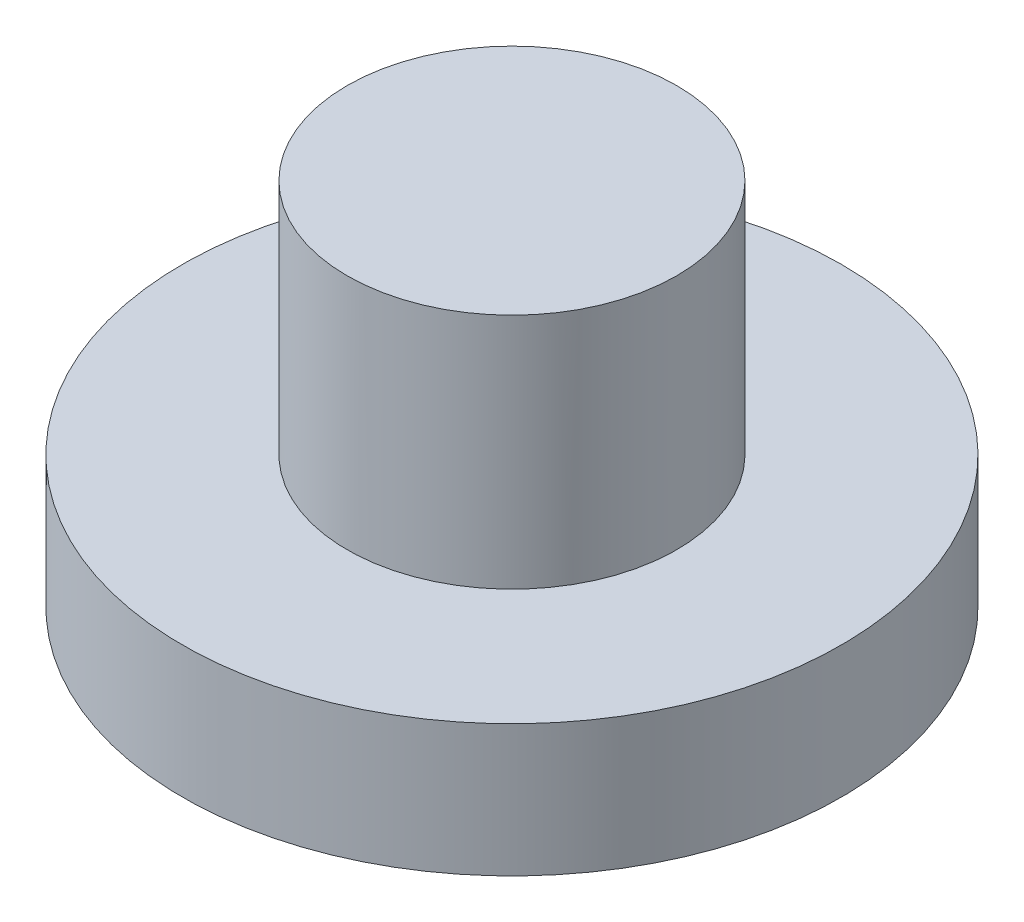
from build123d import *

# Parameters (mm, degrees)
SKETCH1_R           = 0.79375
BOSS_EXTRUDE1_DEPTH = 1.143
SKETCH2_R           = 1.5875
BOSS_EXTRUDE2_DEPTH = 0.635


with BuildPart() as part:
    # Sketch1 → Boss-Extrude1 (new body)
    with BuildSketch(Plane(origin=(0, 0, 0), x_dir=(1, 0, 0), z_dir=(0, 1, 0))):
        with Locations(Location((0, 0, 0), (0, 0, 270))):
            Circle(SKETCH1_R)
    extrude(amount=BOSS_EXTRUDE1_DEPTH)

    # Sketch2 → Boss-Extrude2 (add)
    with BuildSketch(Plane.XZ):
        with Locations(Location((0, 0, 0), (0, 0, 270))):
            Circle(SKETCH2_R)
    extrude(amount=BOSS_EXTRUDE2_DEPTH)

    # Sketch3 → Revolve1 (revolve)
    with BuildSketch(Plane(origin=(0, 0, 0), x_dir=(0, 0, -1), z_dir=(1, 0, 0))):
        with BuildLine():
            Line((0, -1.016), (0, -0.635))
            Line((0, -0.635), (1.5875, -0.635))
            ThreePointArc((1.5875, -0.635), (0.816289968, -0.919416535), (0, -1.016))
        make_face()
    revolve(axis=Axis((0, 0, 0), (0, -1, 0)))


solid = part.part
